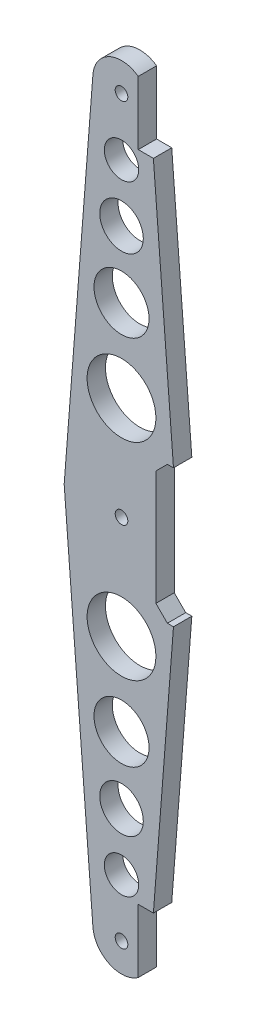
from build123d import *

# Parameters (mm, degrees)
BOSS_EXTRUDE1_DEPTH = 1.6
SKETCH2_R           = 0.55
CUT_EXTRUDE1_DEPTH  = 35.897134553
SKETCH3_R           = 3
SKETCH3_R_2         = 2.4
SKETCH3_R_3         = 1.9
SKETCH3_R_4         = 1.5
SKETCH3_R_5         = 0.55
CUT_EXTRUDE2_DEPTH  = 35.897134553
SKETCH6_W           = 3.079625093
SKETCH6_H           = 6
CUT_EXTRUDE4_DEPTH  = 35.897134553
CUT_EXTRUDE3_DEPTH  = 35.897134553


with BuildPart() as part:
    # Sketch1 → Boss-Extrude1 (new body)
    with BuildSketch(Plane.XY):
        with BuildLine():
            Line((-5, 0), (-2.49245108, 32.194132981))
            ThreePointArc((-2.49245108, 32.194132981), (0, 34.5), (2.49245108, 32.194132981))
            Line((2.49245108, 32.194132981), (5, 0))
            Line((5, 0), (2.49245108, -32.194132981))
            ThreePointArc((2.49245108, -32.194132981), (0, -34.5), (-2.49245108, -32.194132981))
            Line((-2.49245108, -32.194132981), (-5, 0))
        make_face()
    extrude(amount=BOSS_EXTRUDE1_DEPTH)

    # Sketch2 → Cut-Extrude1 (cut, through all)
    with BuildSketch(Plane.XY.offset(1.6)):
        Circle(SKETCH2_R)
    extrude(amount=-CUT_EXTRUDE1_DEPTH, mode=Mode.SUBTRACT)

    # Sketch3 → Cut-Extrude2 (cut, through all)
    with BuildSketch(Plane.XY.offset(1.6)):
        with Locations((0, 9)):
            Circle(SKETCH3_R)
        with Locations((0, 16.2)):
            Circle(SKETCH3_R_2)
        with Locations((0, 22)):
            Circle(SKETCH3_R_3)
        with Locations((0, 27)):
            Circle(SKETCH3_R_4)
        with Locations((0, 32)):
            Circle(SKETCH3_R_5)
    cut_extrude2 = extrude(amount=-CUT_EXTRUDE2_DEPTH, mode=Mode.SUBTRACT)

    # Sketch6 → Cut-Extrude4 (cut, through all)
    with BuildSketch(Plane.XY.offset(1.6)):
        with Locations((2.999812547, 31.5)):
            Rectangle(SKETCH6_W, SKETCH6_H)
    cut_extrude4 = extrude(amount=-CUT_EXTRUDE4_DEPTH, mode=Mode.SUBTRACT)

    # Mirror1: Cut-Extrude2, Cut-Extrude4 across plane
    add(cut_extrude2.mirror(Plane.ZX), mode=Mode.SUBTRACT)
    add(cut_extrude4.mirror(Plane.ZX), mode=Mode.SUBTRACT)

    # Sketch5 → Cut-Extrude3 (cut, through all)
    with BuildSketch(Plane.XY.offset(1.6)):
        Polygon((4, 6), (3, 5), (3, -5), (4, -6), (10, -6), (10, 6), align=None)
    extrude(amount=-CUT_EXTRUDE3_DEPTH, mode=Mode.SUBTRACT)


solid = part.part
